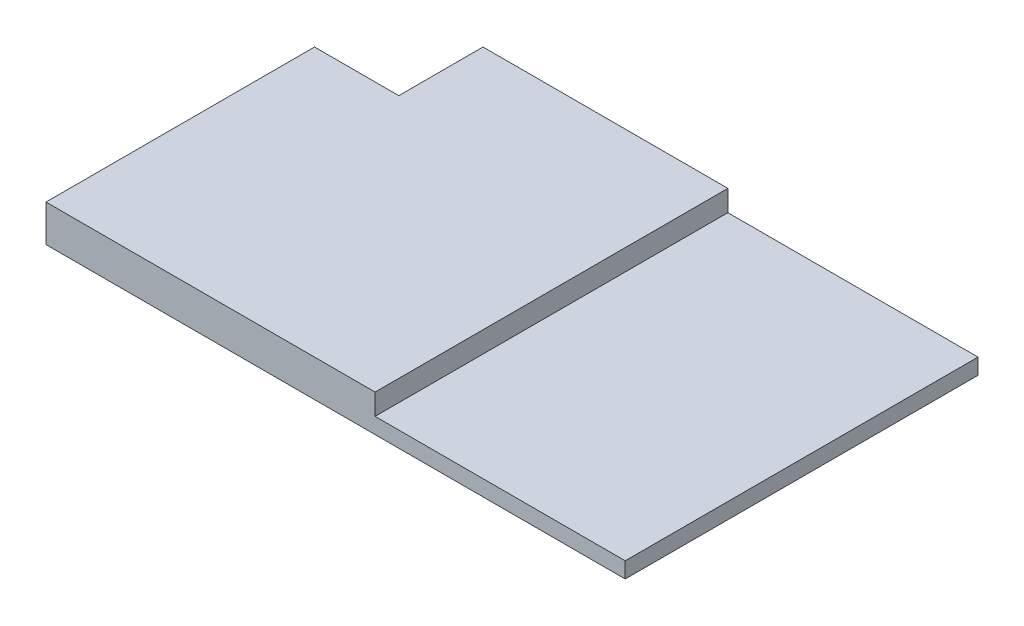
from build123d import *

# Parameters (mm, degrees)
SKETCH1_W           = 110
SKETCH1_H           = 67
BOSS_EXTRUDE1_DEPTH = 7
SKETCH2_W           = 16
SKETCH2_H           = 16
CUT_EXTRUDE1_DEPTH  = 7
SKETCH3_W           = 47.5
SKETCH3_H           = 67
CUT_EXTRUDE2_DEPTH  = 4
SKETCH4_W           = 4.999933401
SKETCH4_H           = 10
BOSS_EXTRUDE2_DEPTH = 5


with BuildPart() as part:
    # Sketch1 → Boss-Extrude1 (new body)
    with BuildSketch(Plane(origin=(0, 0, 0), x_dir=(1, 0, 0), z_dir=(0, 1, 0))):
        Rectangle(SKETCH1_W, SKETCH1_H)
    extrude(amount=BOSS_EXTRUDE1_DEPTH)

    # Sketch2 → Cut-Extrude1 (cut)
    with BuildSketch(Plane(origin=(0, 7, 0), x_dir=(1, 0, 0), z_dir=(0, 1, 0))):
        with Locations((-47, 25.5)):
            Rectangle(SKETCH2_W, SKETCH2_H)
    extrude(amount=-CUT_EXTRUDE1_DEPTH, mode=Mode.SUBTRACT)

    # Sketch3 → Cut-Extrude2 (cut)
    with BuildSketch(Plane(origin=(0, 7, 0), x_dir=(1, 0, 0), z_dir=(0, 1, 0))):
        with Locations((31.25, 0)):
            Rectangle(SKETCH3_W, SKETCH3_H)
    extrude(amount=-CUT_EXTRUDE2_DEPTH, mode=Mode.SUBTRACT)

    # Sketch4 → Boss-Extrude2 (add)
    with BuildSketch(Plane.XZ):
        with Locations((-40.4999667, 0)):
            Rectangle(SKETCH4_W, SKETCH4_H)
    extrude(amount=BOSS_EXTRUDE2_DEPTH)


solid = part.part
